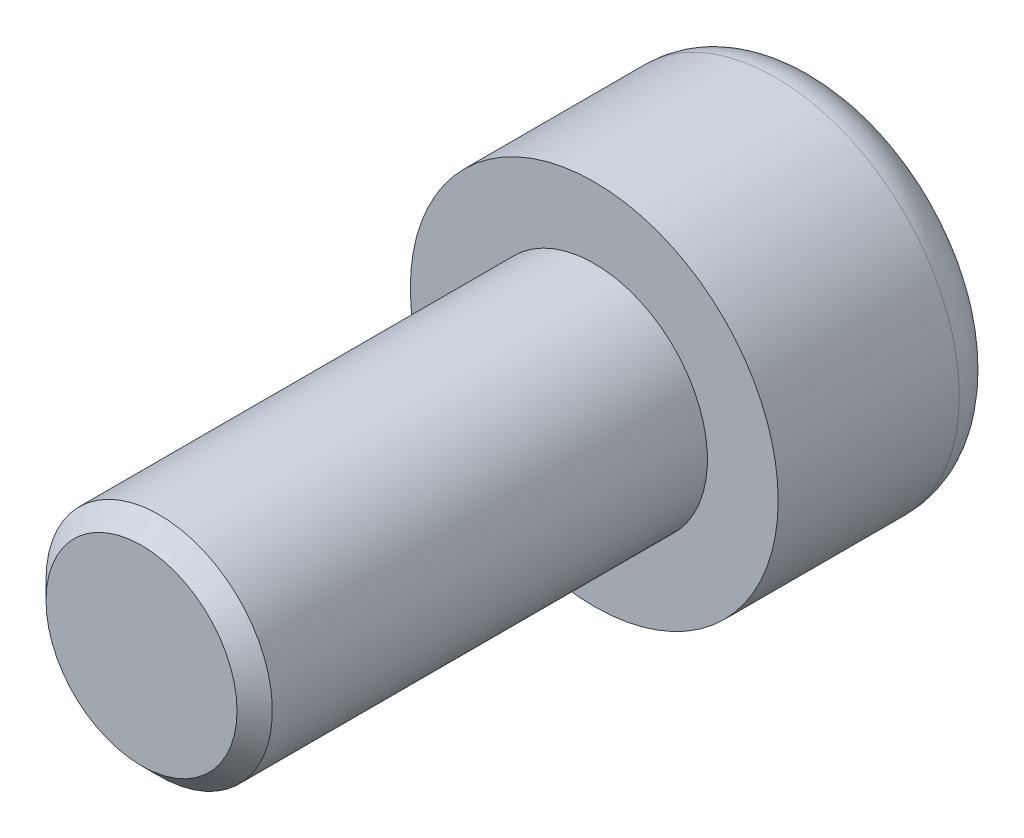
ISO-10303-21;
HEADER;
FILE_DESCRIPTION(('STEP AP214'),'2;1');
FILE_NAME('part.step','',(''),(''),'','','');
FILE_SCHEMA(('AUTOMOTIVE_DESIGN { 1 0 10303 214 1 1 1 1 }'));
ENDSEC;
DATA;
#1=APPLICATION_CONTEXT('core data for automotive mechanical design processes');
#2=APPLICATION_PROTOCOL_DEFINITION('international standard','automotive_design',2000,#1);
#3=PRODUCT_CONTEXT('',#1,'mechanical');
#4=PRODUCT('Part','Part','',(#3));
#5=PRODUCT_RELATED_PRODUCT_CATEGORY('part','',(#4));
#6=PRODUCT_DEFINITION_FORMATION('','',#4);
#7=PRODUCT_DEFINITION_CONTEXT('part definition',#1,'design');
#8=PRODUCT_DEFINITION('design','',#6,#7);
#9=PRODUCT_DEFINITION_SHAPE('','',#8);
#10=(LENGTH_UNIT() NAMED_UNIT(*) SI_UNIT(.MILLI.,.METRE.));
#11=(NAMED_UNIT(*) PLANE_ANGLE_UNIT() SI_UNIT($,.RADIAN.));
#12=(NAMED_UNIT(*) SI_UNIT($,.STERADIAN.) SOLID_ANGLE_UNIT());
#13=UNCERTAINTY_MEASURE_WITH_UNIT(LENGTH_MEASURE(1.E-05),#10,'distance_accuracy_value','');
#14=(GEOMETRIC_REPRESENTATION_CONTEXT(3) GLOBAL_UNCERTAINTY_ASSIGNED_CONTEXT((#13)) GLOBAL_UNIT_ASSIGNED_CONTEXT((#10,
#11,#12)) REPRESENTATION_CONTEXT('',''));
#15=CARTESIAN_POINT('',(0.,0.,0.));
#16=DIRECTION('',(0.,0.,1.));
#17=DIRECTION('',(1.,0.,0.));
#18=AXIS2_PLACEMENT_3D('',#15,#16,#17);
#19=CARTESIAN_POINT('',(-3.,1.73205080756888,5.));
#20=DIRECTION('',(0.,0.,1.));
#21=DIRECTION('',(1.,0.,0.));
#22=AXIS2_PLACEMENT_3D('',#19,#20,#21);
#23=PLANE('',#22);
#24=DIRECTION('',(-0.866025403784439,0.499999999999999,0.));
#25=VECTOR('',#24,1.);
#26=CARTESIAN_POINT('',(0.,3.46410161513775,5.));
#27=LINE('',#26,#25);
#28=CARTESIAN_POINT('',(0.,3.46410161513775,5.));
#29=VERTEX_POINT('',#28);
#30=CARTESIAN_POINT('',(3.,1.73205080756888,5.));
#31=VERTEX_POINT('',#30);
#32=EDGE_CURVE('E65',#29,#31,#27,.F.);
#33=ORIENTED_EDGE('',*,*,#32,.T.);
#34=DIRECTION('',(0.,1.,0.));
#35=VECTOR('',#34,1.);
#36=CARTESIAN_POINT('',(3.,1.73205080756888,5.));
#37=LINE('',#36,#35);
#38=CARTESIAN_POINT('',(3.,-1.73205080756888,5.));
#39=VERTEX_POINT('',#38);
#40=EDGE_CURVE('E62',#31,#39,#37,.F.);
#41=ORIENTED_EDGE('',*,*,#40,.T.);
#42=DIRECTION('',(0.866025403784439,0.499999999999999,0.));
#43=VECTOR('',#42,1.);
#44=CARTESIAN_POINT('',(3.,-1.73205080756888,5.));
#45=LINE('',#44,#43);
#46=CARTESIAN_POINT('',(0.,-3.46410161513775,5.));
#47=VERTEX_POINT('',#46);
#48=EDGE_CURVE('E59',#39,#47,#45,.F.);
#49=ORIENTED_EDGE('',*,*,#48,.T.);
#50=DIRECTION('',(0.866025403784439,-0.499999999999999,0.));
#51=VECTOR('',#50,1.);
#52=CARTESIAN_POINT('',(-3.,-1.73205080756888,5.));
#53=LINE('',#52,#51);
#54=CARTESIAN_POINT('',(-3.,-1.73205080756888,5.));
#55=VERTEX_POINT('',#54);
#56=EDGE_CURVE('E86',#47,#55,#53,.F.);
#57=ORIENTED_EDGE('',*,*,#56,.T.);
#58=DIRECTION('',(0.,1.,0.));
#59=VECTOR('',#58,1.);
#60=CARTESIAN_POINT('',(-3.,1.73205080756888,5.));
#61=LINE('',#60,#59);
#62=CARTESIAN_POINT('',(-3.,1.73205080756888,5.));
#63=VERTEX_POINT('',#62);
#64=EDGE_CURVE('E284',#55,#63,#61,.T.);
#65=ORIENTED_EDGE('',*,*,#64,.T.);
#66=DIRECTION('',(-0.866025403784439,-0.499999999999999,0.));
#67=VECTOR('',#66,1.);
#68=CARTESIAN_POINT('',(0.,3.46410161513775,5.));
#69=LINE('',#68,#67);
#70=EDGE_CURVE('E291',#63,#29,#69,.F.);
#71=ORIENTED_EDGE('',*,*,#70,.T.);
#72=EDGE_LOOP('',(#33,#41,#49,#57,#65,#71));
#73=FACE_BOUND('',#72,.T.);
#74=ADVANCED_FACE('F16',(#73),#23,.F.);
#75=CARTESIAN_POINT('',(3.,1.73205080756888,5.));
#76=DIRECTION('',(1.,0.,0.));
#77=DIRECTION('',(0.,0.,-1.));
#78=AXIS2_PLACEMENT_3D('',#75,#76,#77);
#79=PLANE('',#78);
#80=DIRECTION('',(0.,0.,1.));
#81=VECTOR('',#80,1.);
#82=CARTESIAN_POINT('',(3.,-1.73205080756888,5.));
#83=LINE('',#82,#81);
#84=CARTESIAN_POINT('',(3.,-1.73205080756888,0.));
#85=VERTEX_POINT('',#84);
#86=EDGE_CURVE('E69',#85,#39,#83,.T.);
#87=ORIENTED_EDGE('',*,*,#86,.T.);
#88=ORIENTED_EDGE('',*,*,#40,.F.);
#89=DIRECTION('',(0.,0.,1.));
#90=VECTOR('',#89,1.);
#91=CARTESIAN_POINT('',(3.,1.73205080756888,5.));
#92=LINE('',#91,#90);
#93=CARTESIAN_POINT('',(3.,1.73205080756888,0.));
#94=VERTEX_POINT('',#93);
#95=EDGE_CURVE('E122',#31,#94,#92,.F.);
#96=ORIENTED_EDGE('',*,*,#95,.T.);
#97=DIRECTION('',(0.,1.,0.));
#98=VECTOR('',#97,1.);
#99=CARTESIAN_POINT('',(3.,0.,0.));
#100=LINE('',#99,#98);
#101=EDGE_CURVE('E76',#94,#85,#100,.F.);
#102=ORIENTED_EDGE('',*,*,#101,.T.);
#103=EDGE_LOOP('',(#87,#88,#96,#102));
#104=FACE_BOUND('',#103,.T.);
#105=ADVANCED_FACE('F73',(#104),#79,.F.);
#106=CARTESIAN_POINT('',(3.,-1.73205080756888,5.));
#107=DIRECTION('',(0.499999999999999,-0.866025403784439,0.));
#108=DIRECTION('',(0.866025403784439,0.499999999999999,0.));
#109=AXIS2_PLACEMENT_3D('',#106,#107,#108);
#110=PLANE('',#109);
#111=DIRECTION('',(0.,0.,1.));
#112=VECTOR('',#111,1.);
#113=CARTESIAN_POINT('',(0.,-3.46410161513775,5.));
#114=LINE('',#113,#112);
#115=CARTESIAN_POINT('',(0.,-3.46410161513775,0.));
#116=VERTEX_POINT('',#115);
#117=EDGE_CURVE('E83',#116,#47,#114,.T.);
#118=ORIENTED_EDGE('',*,*,#117,.T.);
#119=ORIENTED_EDGE('',*,*,#48,.F.);
#120=ORIENTED_EDGE('',*,*,#86,.F.);
#121=DIRECTION('',(-0.866025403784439,-0.499999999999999,0.));
#122=VECTOR('',#121,1.);
#123=CARTESIAN_POINT('',(3.,-1.73205080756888,0.));
#124=LINE('',#123,#122);
#125=EDGE_CURVE('E120',#85,#116,#124,.T.);
#126=ORIENTED_EDGE('',*,*,#125,.T.);
#127=EDGE_LOOP('',(#118,#119,#120,#126));
#128=FACE_BOUND('',#127,.T.);
#129=ADVANCED_FACE('F81',(#128),#110,.F.);
#130=CARTESIAN_POINT('',(-3.,-1.73205080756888,5.));
#131=DIRECTION('',(-0.499999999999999,-0.866025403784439,0.));
#132=DIRECTION('',(0.866025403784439,-0.499999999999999,0.));
#133=AXIS2_PLACEMENT_3D('',#130,#131,#132);
#134=PLANE('',#133);
#135=DIRECTION('',(0.,0.,1.));
#136=VECTOR('',#135,1.);
#137=CARTESIAN_POINT('',(-3.,-1.73205080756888,5.));
#138=LINE('',#137,#136);
#139=CARTESIAN_POINT('',(-3.,-1.73205080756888,0.));
#140=VERTEX_POINT('',#139);
#141=EDGE_CURVE('E279',#140,#55,#138,.T.);
#142=ORIENTED_EDGE('',*,*,#141,.T.);
#143=ORIENTED_EDGE('',*,*,#56,.F.);
#144=ORIENTED_EDGE('',*,*,#117,.F.);
#145=DIRECTION('',(-0.866025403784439,0.499999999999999,0.));
#146=VECTOR('',#145,1.);
#147=CARTESIAN_POINT('',(0.,-3.46410161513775,0.));
#148=LINE('',#147,#146);
#149=EDGE_CURVE('E117',#116,#140,#148,.T.);
#150=ORIENTED_EDGE('',*,*,#149,.T.);
#151=EDGE_LOOP('',(#142,#143,#144,#150));
#152=FACE_BOUND('',#151,.T.);
#153=ADVANCED_FACE('F234',(#152),#134,.F.);
#154=CARTESIAN_POINT('',(-3.,1.73205080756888,5.));
#155=DIRECTION('',(-1.,0.,0.));
#156=DIRECTION('',(0.,0.,1.));
#157=AXIS2_PLACEMENT_3D('',#154,#155,#156);
#158=PLANE('',#157);
#159=DIRECTION('',(0.,0.,1.));
#160=VECTOR('',#159,1.);
#161=CARTESIAN_POINT('',(-3.,1.73205080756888,5.));
#162=LINE('',#161,#160);
#163=CARTESIAN_POINT('',(-3.,1.73205080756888,0.));
#164=VERTEX_POINT('',#163);
#165=EDGE_CURVE('E288',#164,#63,#162,.T.);
#166=ORIENTED_EDGE('',*,*,#165,.T.);
#167=ORIENTED_EDGE('',*,*,#64,.F.);
#168=ORIENTED_EDGE('',*,*,#141,.F.);
#169=DIRECTION('',(0.,1.,0.));
#170=VECTOR('',#169,1.);
#171=CARTESIAN_POINT('',(-3.,0.,0.));
#172=LINE('',#171,#170);
#173=EDGE_CURVE('E108',#140,#164,#172,.T.);
#174=ORIENTED_EDGE('',*,*,#173,.T.);
#175=EDGE_LOOP('',(#166,#167,#168,#174));
#176=FACE_BOUND('',#175,.T.);
#177=ADVANCED_FACE('F224',(#176),#158,.F.);
#178=CARTESIAN_POINT('',(0.,3.46410161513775,5.));
#179=DIRECTION('',(-0.499999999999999,0.866025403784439,0.));
#180=DIRECTION('',(-0.866025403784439,-0.499999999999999,0.));
#181=AXIS2_PLACEMENT_3D('',#178,#179,#180);
#182=PLANE('',#181);
#183=DIRECTION('',(0.,0.,1.));
#184=VECTOR('',#183,1.);
#185=CARTESIAN_POINT('',(0.,3.46410161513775,5.));
#186=LINE('',#185,#184);
#187=CARTESIAN_POINT('',(0.,3.46410161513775,0.));
#188=VERTEX_POINT('',#187);
#189=EDGE_CURVE('E295',#188,#29,#186,.T.);
#190=ORIENTED_EDGE('',*,*,#189,.T.);
#191=ORIENTED_EDGE('',*,*,#70,.F.);
#192=ORIENTED_EDGE('',*,*,#165,.F.);
#193=DIRECTION('',(0.866025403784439,0.499999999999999,0.));
#194=VECTOR('',#193,1.);
#195=CARTESIAN_POINT('',(-3.,1.73205080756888,0.));
#196=LINE('',#195,#194);
#197=EDGE_CURVE('E102',#164,#188,#196,.T.);
#198=ORIENTED_EDGE('',*,*,#197,.T.);
#199=EDGE_LOOP('',(#190,#191,#192,#198));
#200=FACE_BOUND('',#199,.T.);
#201=ADVANCED_FACE('F163',(#200),#182,.F.);
#202=CARTESIAN_POINT('',(0.,3.46410161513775,5.));
#203=DIRECTION('',(0.499999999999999,0.866025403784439,0.));
#204=DIRECTION('',(-0.866025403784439,0.499999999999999,0.));
#205=AXIS2_PLACEMENT_3D('',#202,#203,#204);
#206=PLANE('',#205);
#207=ORIENTED_EDGE('',*,*,#95,.F.);
#208=ORIENTED_EDGE('',*,*,#32,.F.);
#209=ORIENTED_EDGE('',*,*,#189,.F.);
#210=DIRECTION('',(0.866025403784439,-0.499999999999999,0.));
#211=VECTOR('',#210,1.);
#212=CARTESIAN_POINT('',(0.,3.46410161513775,0.));
#213=LINE('',#212,#211);
#214=EDGE_CURVE('E100',#188,#94,#213,.T.);
#215=ORIENTED_EDGE('',*,*,#214,.T.);
#216=EDGE_LOOP('',(#207,#208,#209,#215));
#217=FACE_BOUND('',#216,.T.);
#218=ADVANCED_FACE('F157',(#217),#206,.F.);
#219=CARTESIAN_POINT('',(0.,0.,0.));
#220=DIRECTION('',(0.,0.,1.));
#221=DIRECTION('',(1.,0.,0.));
#222=AXIS2_PLACEMENT_3D('',#219,#220,#221);
#223=PLANE('',#222);
#224=ORIENTED_EDGE('',*,*,#197,.F.);
#225=ORIENTED_EDGE('',*,*,#173,.F.);
#226=ORIENTED_EDGE('',*,*,#149,.F.);
#227=ORIENTED_EDGE('',*,*,#125,.F.);
#228=ORIENTED_EDGE('',*,*,#101,.F.);
#229=ORIENTED_EDGE('',*,*,#214,.F.);
#230=EDGE_LOOP('',(#224,#225,#226,#227,#228,#229));
#231=FACE_BOUND('',#230,.T.);
#232=CARTESIAN_POINT('',(0.,0.,0.));
#233=DIRECTION('',(0.,0.,1.));
#234=DIRECTION('',(1.,0.,0.));
#235=AXIS2_PLACEMENT_3D('',#232,#233,#234);
#236=CIRCLE('',#235,4.9);
#237=CARTESIAN_POINT('',(4.9,0.,0.));
#238=VERTEX_POINT('',#237);
#239=CARTESIAN_POINT('',(-4.9,0.,0.));
#240=VERTEX_POINT('',#239);
#241=EDGE_CURVE('E98',#238,#240,#236,.T.);
#242=ORIENTED_EDGE('',*,*,#241,.F.);
#243=CARTESIAN_POINT('',(0.,0.,0.));
#244=DIRECTION('',(0.,0.,1.));
#245=DIRECTION('',(-1.,0.,0.));
#246=AXIS2_PLACEMENT_3D('',#243,#244,#245);
#247=CIRCLE('',#246,4.9);
#248=EDGE_CURVE('E35',#240,#238,#247,.T.);
#249=ORIENTED_EDGE('',*,*,#248,.F.);
#250=EDGE_LOOP('',(#242,#249));
#251=FACE_BOUND('',#250,.T.);
#252=ADVANCED_FACE('F138',(#231,#251),#223,.F.);
#253=CARTESIAN_POINT('',(0.,0.,1.6));
#254=DIRECTION('',(0.,0.,1.));
#255=DIRECTION('',(1.,0.,0.));
#256=AXIS2_PLACEMENT_3D('',#253,#254,#255);
#257=TOROIDAL_SURFACE('',#256,4.9,1.6);
#258=CARTESIAN_POINT('',(0.,0.,1.6));
#259=DIRECTION('',(0.,0.,-1.));
#260=DIRECTION('',(-1.,0.,0.));
#261=AXIS2_PLACEMENT_3D('',#258,#259,#260);
#262=CIRCLE('',#261,6.5);
#263=CARTESIAN_POINT('',(-6.5,0.,1.6));
#264=VERTEX_POINT('',#263);
#265=EDGE_CURVE('E95',#264,#264,#262,.F.);
#266=ORIENTED_EDGE('',*,*,#265,.F.);
#267=EDGE_LOOP('',(#266));
#268=FACE_BOUND('',#267,.T.);
#269=ORIENTED_EDGE('',*,*,#241,.T.);
#270=ORIENTED_EDGE('',*,*,#248,.T.);
#271=EDGE_LOOP('',(#269,#270));
#272=FACE_BOUND('',#271,.T.);
#273=ADVANCED_FACE('F97',(#268,#272),#257,.T.);
#274=CARTESIAN_POINT('',(0.,0.,24.));
#275=DIRECTION('',(0.,0.,1.));
#276=DIRECTION('',(1.,0.,0.));
#277=AXIS2_PLACEMENT_3D('',#274,#275,#276);
#278=PLANE('',#277);
#279=CARTESIAN_POINT('',(0.,0.,24.0000000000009));
#280=DIRECTION('',(0.,0.,-1.));
#281=DIRECTION('',(-1.,0.,0.));
#282=AXIS2_PLACEMENT_3D('',#279,#280,#281);
#283=CIRCLE('',#282,3.37500000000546);
#284=CARTESIAN_POINT('',(-3.37500000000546,0.,24.0000000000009));
#285=VERTEX_POINT('',#284);
#286=EDGE_CURVE('E93',#285,#285,#283,.T.);
#287=ORIENTED_EDGE('',*,*,#286,.F.);
#288=EDGE_LOOP('',(#287));
#289=FACE_BOUND('',#288,.T.);
#290=ADVANCED_FACE('F137',(#289),#278,.T.);
#291=CARTESIAN_POINT('',(0.,0.,8.));
#292=DIRECTION('',(0.,0.,-1.));
#293=DIRECTION('',(-1.,0.,0.));
#294=AXIS2_PLACEMENT_3D('',#291,#292,#293);
#295=CYLINDRICAL_SURFACE('',#294,6.5);
#296=ORIENTED_EDGE('',*,*,#265,.T.);
#297=EDGE_LOOP('',(#296));
#298=FACE_BOUND('',#297,.T.);
#299=CARTESIAN_POINT('',(0.,0.,8.));
#300=DIRECTION('',(0.,0.,-1.));
#301=DIRECTION('',(-1.,0.,0.));
#302=AXIS2_PLACEMENT_3D('',#299,#300,#301);
#303=CIRCLE('',#302,6.5);
#304=CARTESIAN_POINT('',(-6.5,0.,8.));
#305=VERTEX_POINT('',#304);
#306=EDGE_CURVE('E90',#305,#305,#303,.F.);
#307=ORIENTED_EDGE('',*,*,#306,.F.);
#308=EDGE_LOOP('',(#307));
#309=FACE_BOUND('',#308,.T.);
#310=ADVANCED_FACE('F179',(#298,#309),#295,.T.);
#311=CARTESIAN_POINT('',(0.,0.,23.3749999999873));
#312=DIRECTION('',(0.,0.,-1.));
#313=DIRECTION('',(-1.,0.,0.));
#314=AXIS2_PLACEMENT_3D('',#311,#312,#313);
#315=CONICAL_SURFACE('',#314,4.0000000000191,0.785398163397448);
#316=CARTESIAN_POINT('',(0.,0.,23.3749999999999));
#317=DIRECTION('',(0.,0.,-1.));
#318=DIRECTION('',(-1.,0.,0.));
#319=AXIS2_PLACEMENT_3D('',#316,#317,#318);
#320=CIRCLE('',#319,4.);
#321=CARTESIAN_POINT('',(-4.,0.,23.3749999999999));
#322=VERTEX_POINT('',#321);
#323=EDGE_CURVE('E27',#322,#322,#320,.T.);
#324=ORIENTED_EDGE('',*,*,#323,.F.);
#325=EDGE_LOOP('',(#324));
#326=FACE_BOUND('',#325,.T.);
#327=ORIENTED_EDGE('',*,*,#286,.T.);
#328=EDGE_LOOP('',(#327));
#329=FACE_BOUND('',#328,.T.);
#330=ADVANCED_FACE('F173',(#326,#329),#315,.T.);
#331=CARTESIAN_POINT('',(0.,0.,8.));
#332=DIRECTION('',(0.,0.,1.));
#333=DIRECTION('',(1.,0.,0.));
#334=AXIS2_PLACEMENT_3D('',#331,#332,#333);
#335=PLANE('',#334);
#336=CARTESIAN_POINT('',(0.,0.,8.));
#337=DIRECTION('',(0.,0.,-1.));
#338=DIRECTION('',(-1.,0.,0.));
#339=AXIS2_PLACEMENT_3D('',#336,#337,#338);
#340=CIRCLE('',#339,4.);
#341=CARTESIAN_POINT('',(-4.,0.,8.));
#342=VERTEX_POINT('',#341);
#343=EDGE_CURVE('E11',#342,#342,#340,.F.);
#344=ORIENTED_EDGE('',*,*,#343,.F.);
#345=EDGE_LOOP('',(#344));
#346=FACE_BOUND('',#345,.T.);
#347=ORIENTED_EDGE('',*,*,#306,.T.);
#348=EDGE_LOOP('',(#347));
#349=FACE_BOUND('',#348,.T.);
#350=ADVANCED_FACE('F167',(#346,#349),#335,.T.);
#351=CARTESIAN_POINT('',(0.,0.,24.));
#352=DIRECTION('',(0.,0.,-1.));
#353=DIRECTION('',(-1.,0.,0.));
#354=AXIS2_PLACEMENT_3D('',#351,#352,#353);
#355=CYLINDRICAL_SURFACE('',#354,4.);
#356=ORIENTED_EDGE('',*,*,#343,.T.);
#357=EDGE_LOOP('',(#356));
#358=FACE_BOUND('',#357,.T.);
#359=ORIENTED_EDGE('',*,*,#323,.T.);
#360=EDGE_LOOP('',(#359));
#361=FACE_BOUND('',#360,.T.);
#362=ADVANCED_FACE('F165',(#358,#361),#355,.T.);
#363=CLOSED_SHELL('',(#74,#105,#129,#153,#177,#201,#218,#252,#273,#290,#310,#330,#350,#362));
#364=MANIFOLD_SOLID_BREP('B1',#363);
#365=ADVANCED_BREP_SHAPE_REPRESENTATION('',(#18,#364),#14);
#366=SHAPE_DEFINITION_REPRESENTATION(#9,#365);
ENDSEC;
END-ISO-10303-21;
